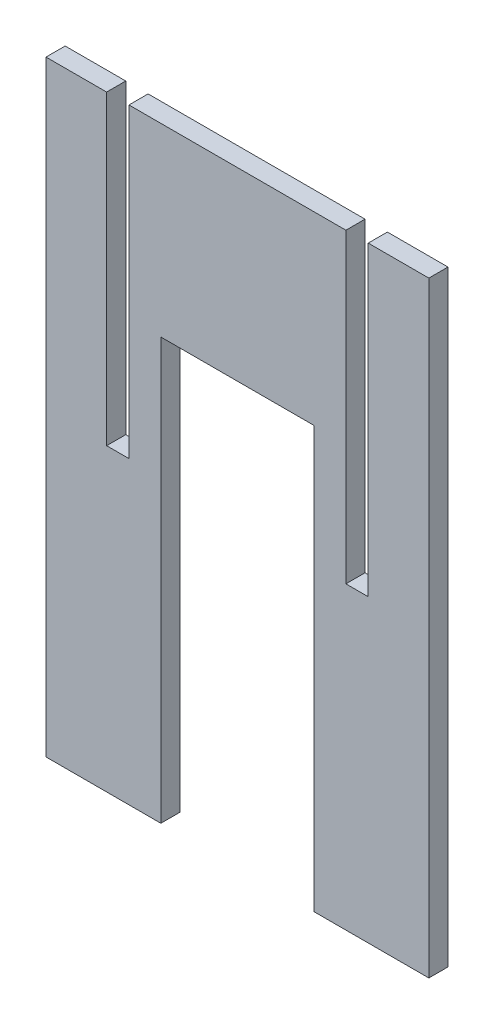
from build123d import *

# Parameters (mm, degrees)
ESQUISSE1_W             = 60
ESQUISSE1_H             = 95
EXTRUSION1_DEPTH        = 3
ESQUISSE2_W             = 24
ESQUISSE2_H             = 66
ENL_V_MAT_EXTRU_1_DEPTH = 3
ESQUISSE3_W             = 3.5
ESQUISSE3_H             = 48
ENL_V_MAT_EXTRU_2_DEPTH = 3


with BuildPart() as part:
    # Esquisse1 → Extrusion1 (new body)
    with BuildSketch(Plane.XY):
        with Locations((30, 47.5)):
            Rectangle(ESQUISSE1_W, ESQUISSE1_H)
    extrude(amount=EXTRUSION1_DEPTH)

    # Esquisse2 → Enl_v. mat.-Extru.1 (cut)
    with BuildSketch(Plane.XY.offset(3)):
        with Locations((30, 33)):
            Rectangle(ESQUISSE2_W, ESQUISSE2_H)
    extrude(amount=-ENL_V_MAT_EXTRU_1_DEPTH, mode=Mode.SUBTRACT)

    # Esquisse3 → Enl_v. mat.-Extru.2 (cut)
    with BuildSketch(Plane.XY.offset(3)):
        with Locations((11.25, 71)):
            Rectangle(ESQUISSE3_W, ESQUISSE3_H)
        with Locations((48.75, 71)):
            Rectangle(ESQUISSE3_W, ESQUISSE3_H)
    extrude(amount=-ENL_V_MAT_EXTRU_2_DEPTH, mode=Mode.SUBTRACT)


solid = part.part
